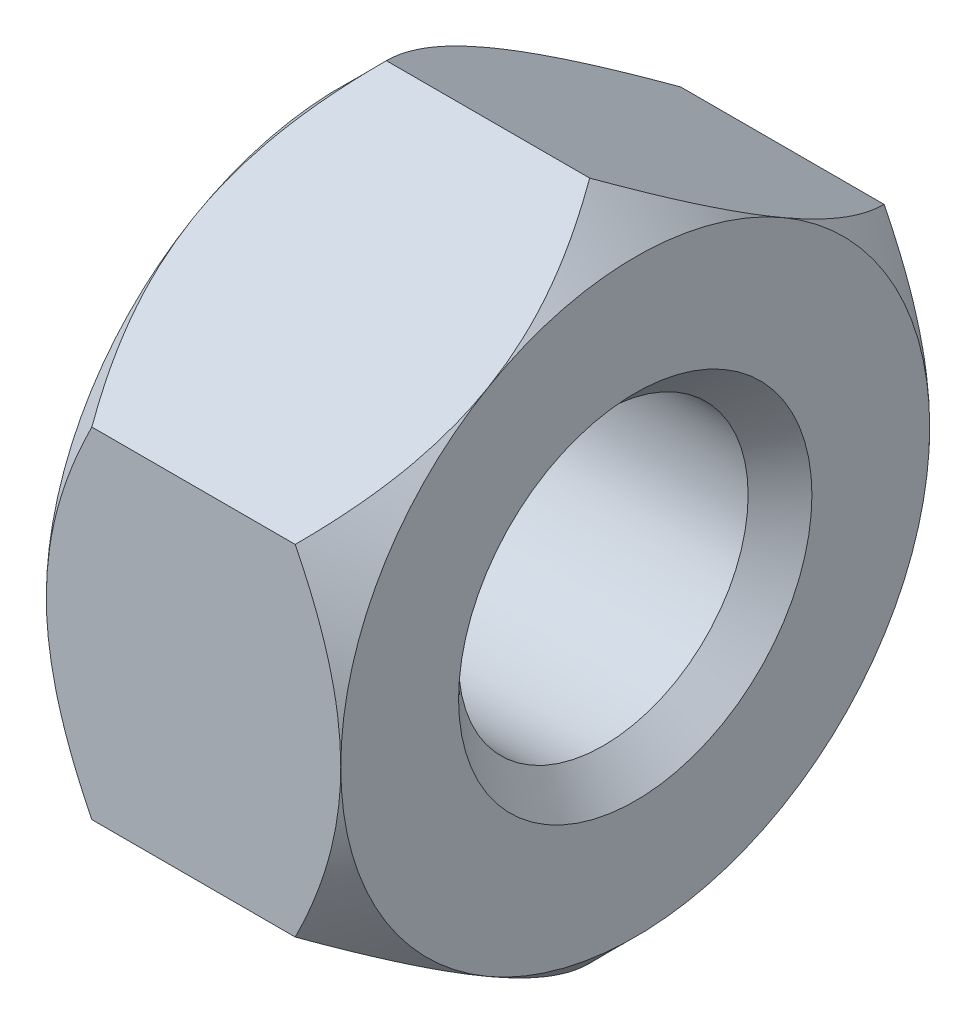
ISO-10303-21;
HEADER;
FILE_DESCRIPTION(('STEP AP214'),'2;1');
FILE_NAME('part.step','',(''),(''),'','','');
FILE_SCHEMA(('AUTOMOTIVE_DESIGN { 1 0 10303 214 1 1 1 1 }'));
ENDSEC;
DATA;
#1=APPLICATION_CONTEXT('core data for automotive mechanical design processes');
#2=APPLICATION_PROTOCOL_DEFINITION('international standard','automotive_design',2000,#1);
#3=PRODUCT_CONTEXT('',#1,'mechanical');
#4=PRODUCT('Part','Part','',(#3));
#5=PRODUCT_RELATED_PRODUCT_CATEGORY('part','',(#4));
#6=PRODUCT_DEFINITION_FORMATION('','',#4);
#7=PRODUCT_DEFINITION_CONTEXT('part definition',#1,'design');
#8=PRODUCT_DEFINITION('design','',#6,#7);
#9=PRODUCT_DEFINITION_SHAPE('','',#8);
#10=(LENGTH_UNIT() NAMED_UNIT(*) SI_UNIT(.MILLI.,.METRE.));
#11=(NAMED_UNIT(*) PLANE_ANGLE_UNIT() SI_UNIT($,.RADIAN.));
#12=(NAMED_UNIT(*) SI_UNIT($,.STERADIAN.) SOLID_ANGLE_UNIT());
#13=UNCERTAINTY_MEASURE_WITH_UNIT(LENGTH_MEASURE(1.E-05),#10,'distance_accuracy_value','');
#14=(GEOMETRIC_REPRESENTATION_CONTEXT(3) GLOBAL_UNCERTAINTY_ASSIGNED_CONTEXT((#13)) GLOBAL_UNIT_ASSIGNED_CONTEXT((#10,
#11,#12)) REPRESENTATION_CONTEXT('',''));
#15=CARTESIAN_POINT('',(0.,0.,0.));
#16=DIRECTION('',(0.,0.,1.));
#17=DIRECTION('',(1.,0.,0.));
#18=AXIS2_PLACEMENT_3D('',#15,#16,#17);
#19=CARTESIAN_POINT('',(1.,0.,0.));
#20=DIRECTION('',(1.,0.,0.));
#21=DIRECTION('',(0.,0.,-1.));
#22=AXIS2_PLACEMENT_3D('',#19,#20,#21);
#23=CONICAL_SURFACE('',#22,6.,0.785398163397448);
#24=CARTESIAN_POINT('',(2.8998967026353,-6.11623805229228,-5.));
#25=CARTESIAN_POINT('',(2.78578832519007,-5.96881967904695,-5.));
#26=CARTESIAN_POINT('',(2.67267681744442,-5.82061751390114,-5.));
#27=CARTESIAN_POINT('',(2.44890598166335,-5.52232154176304,-5.));
#28=CARTESIAN_POINT('',(2.3382472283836,-5.37222730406,-5.));
#29=CARTESIAN_POINT('',(2.11905330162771,-5.06872758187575,-5.));
#30=CARTESIAN_POINT('',(2.01054103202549,-4.91530550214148,-5.));
#31=CARTESIAN_POINT('',(1.79720519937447,-4.60592635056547,-5.));
#32=CARTESIAN_POINT('',(1.69238138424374,-4.44996945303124,-5.));
#33=CARTESIAN_POINT('',(1.48054287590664,-4.12476064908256,-5.));
#34=CARTESIAN_POINT('',(1.37383538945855,-3.95530762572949,-5.));
#35=CARTESIAN_POINT('',(1.16691630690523,-3.6124168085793,-5.));
#36=CARTESIAN_POINT('',(1.06670582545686,-3.43897833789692,-5.));
#37=CARTESIAN_POINT('',(0.874905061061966,-3.08804784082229,-5.));
#38=CARTESIAN_POINT('',(0.783289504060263,-2.91056973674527,-5.));
#39=CARTESIAN_POINT('',(0.610731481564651,-2.55053951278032,-5.));
#40=CARTESIAN_POINT('',(0.529783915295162,-2.36798986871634,-5.));
#41=CARTESIAN_POINT('',(0.389256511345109,-2.0167294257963,-5.));
#42=CARTESIAN_POINT('',(0.328328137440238,-1.84856364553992,-5.));
#43=CARTESIAN_POINT('',(0.219924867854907,-1.50786920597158,-5.));
#44=CARTESIAN_POINT('',(0.172450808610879,-1.3353402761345,-5.));
#45=CARTESIAN_POINT('',(0.094350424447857,-0.990002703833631,-5.));
#46=CARTESIAN_POINT('',(0.0634120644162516,-0.817265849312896,-5.));
#47=CARTESIAN_POINT('',(0.0190421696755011,-0.46954548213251,-5.));
#48=CARTESIAN_POINT('',(0.00560676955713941,-0.294562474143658,-5.));
#49=CARTESIAN_POINT('',(-0.00256353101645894,0.0477036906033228,-5.));
#50=CARTESIAN_POINT('',(0.00186182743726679,0.214966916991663,-5.));
#51=CARTESIAN_POINT('',(0.0272192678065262,0.548228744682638,-5.));
#52=CARTESIAN_POINT('',(0.0481528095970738,0.714227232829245,-5.));
#53=CARTESIAN_POINT('',(0.105684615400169,1.04657494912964,-5.));
#54=CARTESIAN_POINT('',(0.142562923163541,1.21287485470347,-5.));
#55=CARTESIAN_POINT('',(0.229911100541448,1.54179706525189,-5.));
#56=CARTESIAN_POINT('',(0.280380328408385,1.70441954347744,-5.));
#57=CARTESIAN_POINT('',(0.395277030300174,2.03318818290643,-5.));
#58=CARTESIAN_POINT('',(0.460247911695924,2.19914218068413,-5.));
#59=CARTESIAN_POINT('',(0.600242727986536,2.52679192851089,-5.));
#60=CARTESIAN_POINT('',(0.675271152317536,2.68848573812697,-5.));
#61=CARTESIAN_POINT('',(0.833602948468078,3.00837157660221,-5.));
#62=CARTESIAN_POINT('',(0.916931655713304,3.16655096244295,-5.));
#63=CARTESIAN_POINT('',(1.09003257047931,3.47928908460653,-5.));
#64=CARTESIAN_POINT('',(1.17980379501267,3.63384836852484,-5.));
#65=CARTESIAN_POINT('',(1.35998001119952,3.93227446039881,-5.));
#66=CARTESIAN_POINT('',(1.45013548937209,4.07629271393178,-5.));
#67=CARTESIAN_POINT('',(1.63429529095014,4.36185452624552,-5.));
#68=CARTESIAN_POINT('',(1.72829990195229,4.50339789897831,-5.));
#69=CARTESIAN_POINT('',(1.91870984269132,4.78319864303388,-5.));
#70=CARTESIAN_POINT('',(2.01508994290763,4.92147324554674,-5.));
#71=CARTESIAN_POINT('',(2.21044237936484,5.19612379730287,-5.));
#72=CARTESIAN_POINT('',(2.30941399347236,5.33250025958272,-5.));
#73=CARTESIAN_POINT('',(2.40944669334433,5.46808012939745,-5.));
#74=B_SPLINE_CURVE_WITH_KNOTS('',3,(#24,#25,#26,#27,#28,#29,#30,#31,#32,#33,#34,#35,#36,#37,#38,
#39,#40,#41,#42,#43,#44,#45,#46,#47,#48,#49,#50,#51,#52,#53,#54,#55,#56,#57,#58,#59,#60,#61,#62,
#63,#64,#65,#66,#67,#68,#69,#70,#71,#72,#73),.UNSPECIFIED.,.F.,.F.,(4,2,2,2,2,2,2,2,2,2,2,2,2,2,
2,2,2,2,2,2,2,2,2,2,4),(0.,0.559273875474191,1.11867744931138,1.68238716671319,2.24605828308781,
2.84669811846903,3.44744073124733,4.046357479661,4.64498681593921,5.18111629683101,
5.71727910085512,6.24293106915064,6.76846693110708,7.26958890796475,7.77075520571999,
8.28110595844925,8.79143261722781,9.32568132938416,9.86016931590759,10.3963418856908,
10.9324328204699,11.442089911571,11.9517851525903,12.4574018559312,12.9628791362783),.UNSPECIFIED.);
#75=CARTESIAN_POINT('',(0.773502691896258,-2.88675134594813,-5.));
#76=VERTEX_POINT('',#75);
#77=CARTESIAN_POINT('',(0.,0.,-5.));
#78=VERTEX_POINT('',#77);
#79=EDGE_CURVE('E333',#76,#78,#74,.T.);
#80=ORIENTED_EDGE('',*,*,#79,.F.);
#81=CARTESIAN_POINT('',(0.773618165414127,-5.7736181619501,0.000200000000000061));
#82=CARTESIAN_POINT('',(0.723986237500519,-5.72398176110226,-0.0857727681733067));
#83=CARTESIAN_POINT('',(0.675877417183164,-5.67396382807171,-0.172406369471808));
#84=CARTESIAN_POINT('',(0.58316932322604,-5.57309004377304,-0.347124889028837));
#85=CARTESIAN_POINT('',(0.538571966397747,-5.5222337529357,-0.435210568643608));
#86=CARTESIAN_POINT('',(0.410361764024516,-5.367822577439,-0.702658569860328));
#87=CARTESIAN_POINT('',(0.332877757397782,-5.26296050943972,-0.884284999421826));
#88=CARTESIAN_POINT('',(0.200191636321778,-5.05149774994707,-1.25054924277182));
#89=CARTESIAN_POINT('',(0.144655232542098,-4.94495110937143,-1.4350934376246));
#90=CARTESIAN_POINT('',(0.0804131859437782,-4.78337944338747,-1.71494377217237));
#91=CARTESIAN_POINT('',(0.0621848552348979,-4.72928433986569,-1.80863923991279));
#92=CARTESIAN_POINT('',(0.0324948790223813,-4.6206360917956,-1.99682352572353));
#93=CARTESIAN_POINT('',(0.021032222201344,-4.56608301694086,-2.09131222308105));
#94=CARTESIAN_POINT('',(0.00181355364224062,-4.43314578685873,-2.32156625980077));
#95=CARTESIAN_POINT('',(-0.00221901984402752,-4.35461839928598,-2.45757968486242));
#96=CARTESIAN_POINT('',(0.00454854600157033,-4.19770514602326,-2.72936141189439));
#97=CARTESIAN_POINT('',(0.015353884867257,-4.1193193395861,-2.86512961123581));
#98=CARTESIAN_POINT('',(0.0511603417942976,-3.96328672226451,-3.13538603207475));
#99=CARTESIAN_POINT('',(0.0761773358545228,-3.88564083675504,-3.26987265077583));
#100=CARTESIAN_POINT('',(0.139047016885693,-3.73168360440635,-3.53653439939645));
#101=CARTESIAN_POINT('',(0.176898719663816,-3.65537215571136,-3.66870970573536));
#102=CARTESIAN_POINT('',(0.254772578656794,-3.51990355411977,-3.9033482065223));
#103=CARTESIAN_POINT('',(0.292746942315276,-3.4604464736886,-4.00633089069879));
#104=CARTESIAN_POINT('',(0.374815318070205,-3.34259967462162,-4.21044753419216));
#105=CARTESIAN_POINT('',(0.418909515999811,-3.28420998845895,-4.31158143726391));
#106=CARTESIAN_POINT('',(0.512229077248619,-3.16868188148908,-4.51168198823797));
#107=CARTESIAN_POINT('',(0.561438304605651,-3.11154017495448,-4.61065432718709));
#108=CARTESIAN_POINT('',(0.664341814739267,-2.99831490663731,-4.80676624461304));
#109=CARTESIAN_POINT('',(0.718033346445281,-2.94223072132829,-4.90390690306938));
#110=CARTESIAN_POINT('',(0.773618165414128,-2.88663587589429,-5.0002));
#111=B_SPLINE_CURVE_WITH_KNOTS('',3,(#81,#82,#83,#84,#85,#86,#87,#88,#89,#90,#91,#92,#93,#94,
#95,#96,#97,#98,#99,#100,#101,#102,#103,#104,#105,#106,#107,#108,#109,#110),.UNSPECIFIED.,.F.,
.F.,(4,2,2,2,2,2,2,2,2,2,2,2,2,2,4),(0.,0.332945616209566,0.666071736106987,1.33592065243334,
1.99513262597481,2.32409207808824,2.6530023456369,3.12358963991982,3.59434188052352,
4.06562104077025,4.53686407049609,4.91117956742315,5.28550643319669,5.65868635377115,
6.03163889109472),.UNSPECIFIED.);
#112=CARTESIAN_POINT('',(-6.0539832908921E-13,-4.33012701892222,-2.49999999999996));
#113=VERTEX_POINT('',#112);
#114=EDGE_CURVE('E168',#113,#76,#111,.T.);
#115=ORIENTED_EDGE('',*,*,#114,.F.);
#116=CARTESIAN_POINT('',(0.,0.,0.));
#117=DIRECTION('',(-1.,0.,0.));
#118=DIRECTION('',(0.,0.,1.));
#119=AXIS2_PLACEMENT_3D('',#116,#117,#118);
#120=CIRCLE('',#119,5.);
#121=EDGE_CURVE('E324',#78,#113,#120,.T.);
#122=ORIENTED_EDGE('',*,*,#121,.F.);
#123=EDGE_LOOP('',(#80,#115,#122));
#124=FACE_BOUND('',#123,.T.);
#125=ADVANCED_FACE('F16',(#124),#23,.T.);
#126=CARTESIAN_POINT('',(0.773502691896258,2.88675134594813,-5.));
#127=VERTEX_POINT('',#126);
#128=EDGE_CURVE('E176',#78,#127,#74,.T.);
#129=ORIENTED_EDGE('',*,*,#128,.F.);
#130=CARTESIAN_POINT('',(-6.05850612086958E-13,4.33012701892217,-2.50000000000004));
#131=VERTEX_POINT('',#130);
#132=EDGE_CURVE('E325',#131,#78,#120,.T.);
#133=ORIENTED_EDGE('',*,*,#132,.F.);
#134=CARTESIAN_POINT('',(0.773618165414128,2.88663587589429,-5.0002));
#135=CARTESIAN_POINT('',(0.723986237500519,2.93627227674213,-4.91422723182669));
#136=CARTESIAN_POINT('',(0.675877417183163,2.98629020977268,-4.82759363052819));
#137=CARTESIAN_POINT('',(0.583169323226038,3.08716399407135,-4.65287511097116));
#138=CARTESIAN_POINT('',(0.538571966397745,3.13802028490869,-4.56478943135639));
#139=CARTESIAN_POINT('',(0.410361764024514,3.29243146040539,-4.29734143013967));
#140=CARTESIAN_POINT('',(0.332877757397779,3.39729352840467,-4.11571500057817));
#141=CARTESIAN_POINT('',(0.200191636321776,3.60875628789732,-3.74945075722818));
#142=CARTESIAN_POINT('',(0.144655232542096,3.71530292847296,-3.56490656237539));
#143=CARTESIAN_POINT('',(0.0804131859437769,3.87687459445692,-3.28505622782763));
#144=CARTESIAN_POINT('',(0.0621848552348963,3.9309696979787,-3.19136076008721));
#145=CARTESIAN_POINT('',(0.03249487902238,4.03961794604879,-3.00317647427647));
#146=CARTESIAN_POINT('',(0.0210322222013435,4.09417102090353,-2.90868777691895));
#147=CARTESIAN_POINT('',(0.00181355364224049,4.22710825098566,-2.67843374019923));
#148=CARTESIAN_POINT('',(-0.00221901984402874,4.3056356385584,-2.54242031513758));
#149=CARTESIAN_POINT('',(0.00454854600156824,4.46254889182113,-2.27063858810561));
#150=CARTESIAN_POINT('',(0.0153538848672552,4.54093469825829,-2.13487038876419));
#151=CARTESIAN_POINT('',(0.051160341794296,4.69696731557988,-1.86461396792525));
#152=CARTESIAN_POINT('',(0.0761773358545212,4.77461320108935,-1.73012734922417));
#153=CARTESIAN_POINT('',(0.139047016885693,4.92857043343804,-1.46346560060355));
#154=CARTESIAN_POINT('',(0.176898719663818,5.00488188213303,-1.33129029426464));
#155=CARTESIAN_POINT('',(0.254772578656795,5.14035048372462,-1.0966517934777));
#156=CARTESIAN_POINT('',(0.292746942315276,5.19980756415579,-0.993669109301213));
#157=CARTESIAN_POINT('',(0.374815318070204,5.31765436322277,-0.789552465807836));
#158=CARTESIAN_POINT('',(0.418909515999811,5.37604404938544,-0.688418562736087));
#159=CARTESIAN_POINT('',(0.512229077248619,5.49157215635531,-0.488318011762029));
#160=CARTESIAN_POINT('',(0.56143830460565,5.54871386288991,-0.389345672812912));
#161=CARTESIAN_POINT('',(0.664341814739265,5.66193913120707,-0.193233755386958));
#162=CARTESIAN_POINT('',(0.718033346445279,5.7180233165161,-0.096093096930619));
#163=CARTESIAN_POINT('',(0.773618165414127,5.7736181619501,0.000199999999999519));
#164=B_SPLINE_CURVE_WITH_KNOTS('',3,(#134,#135,#136,#137,#138,#139,#140,#141,#142,#143,#144,
#145,#146,#147,#148,#149,#150,#151,#152,#153,#154,#155,#156,#157,#158,#159,#160,#161,#162,#163),
.UNSPECIFIED.,.F.,.F.,(4,2,2,2,2,2,2,2,2,2,2,2,2,2,4),(0.,0.332945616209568,0.666071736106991,
1.33592065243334,1.99513262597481,2.32409207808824,2.6530023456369,3.12358963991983,
3.59434188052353,4.06562104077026,4.53686407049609,4.91117956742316,5.28550643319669,
5.65868635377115,6.03163889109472),.UNSPECIFIED.);
#165=EDGE_CURVE('E191',#127,#131,#164,.T.);
#166=ORIENTED_EDGE('',*,*,#165,.F.);
#167=EDGE_LOOP('',(#129,#133,#166));
#168=FACE_BOUND('',#167,.T.);
#169=ADVANCED_FACE('F150',(#168),#23,.T.);
#170=CARTESIAN_POINT('',(0.773502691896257,5.77350269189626,0.));
#171=VERTEX_POINT('',#170);
#172=EDGE_CURVE('E184',#131,#171,#164,.T.);
#173=ORIENTED_EDGE('',*,*,#172,.F.);
#174=CARTESIAN_POINT('',(-6.0539832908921E-13,4.33012701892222,2.49999999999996));
#175=VERTEX_POINT('',#174);
#176=EDGE_CURVE('E24',#175,#131,#120,.T.);
#177=ORIENTED_EDGE('',*,*,#176,.F.);
#178=CARTESIAN_POINT('',(0.773618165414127,5.7736181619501,-0.000200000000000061));
#179=CARTESIAN_POINT('',(0.723986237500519,5.72398176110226,0.0857727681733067));
#180=CARTESIAN_POINT('',(0.675877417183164,5.67396382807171,0.172406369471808));
#181=CARTESIAN_POINT('',(0.58316932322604,5.57309004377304,0.347124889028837));
#182=CARTESIAN_POINT('',(0.538571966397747,5.5222337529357,0.435210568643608));
#183=CARTESIAN_POINT('',(0.410361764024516,5.367822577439,0.702658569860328));
#184=CARTESIAN_POINT('',(0.332877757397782,5.26296050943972,0.884284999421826));
#185=CARTESIAN_POINT('',(0.200191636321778,5.05149774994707,1.25054924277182));
#186=CARTESIAN_POINT('',(0.144655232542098,4.94495110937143,1.4350934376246));
#187=CARTESIAN_POINT('',(0.0804131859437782,4.78337944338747,1.71494377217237));
#188=CARTESIAN_POINT('',(0.0621848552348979,4.72928433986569,1.80863923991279));
#189=CARTESIAN_POINT('',(0.0324948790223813,4.6206360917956,1.99682352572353));
#190=CARTESIAN_POINT('',(0.021032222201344,4.56608301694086,2.09131222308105));
#191=CARTESIAN_POINT('',(0.00181355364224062,4.43314578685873,2.32156625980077));
#192=CARTESIAN_POINT('',(-0.00221901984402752,4.35461839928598,2.45757968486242));
#193=CARTESIAN_POINT('',(0.00454854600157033,4.19770514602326,2.72936141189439));
#194=CARTESIAN_POINT('',(0.015353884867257,4.1193193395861,2.86512961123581));
#195=CARTESIAN_POINT('',(0.0511603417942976,3.96328672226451,3.13538603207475));
#196=CARTESIAN_POINT('',(0.0761773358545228,3.88564083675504,3.26987265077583));
#197=CARTESIAN_POINT('',(0.139047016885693,3.73168360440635,3.53653439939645));
#198=CARTESIAN_POINT('',(0.176898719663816,3.65537215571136,3.66870970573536));
#199=CARTESIAN_POINT('',(0.254772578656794,3.51990355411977,3.9033482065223));
#200=CARTESIAN_POINT('',(0.292746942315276,3.4604464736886,4.00633089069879));
#201=CARTESIAN_POINT('',(0.374815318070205,3.34259967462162,4.21044753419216));
#202=CARTESIAN_POINT('',(0.418909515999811,3.28420998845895,4.31158143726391));
#203=CARTESIAN_POINT('',(0.512229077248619,3.16868188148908,4.51168198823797));
#204=CARTESIAN_POINT('',(0.561438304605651,3.11154017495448,4.61065432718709));
#205=CARTESIAN_POINT('',(0.664341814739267,2.99831490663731,4.80676624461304));
#206=CARTESIAN_POINT('',(0.718033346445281,2.94223072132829,4.90390690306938));
#207=CARTESIAN_POINT('',(0.773618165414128,2.88663587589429,5.0002));
#208=B_SPLINE_CURVE_WITH_KNOTS('',3,(#178,#179,#180,#181,#182,#183,#184,#185,#186,#187,#188,
#189,#190,#191,#192,#193,#194,#195,#196,#197,#198,#199,#200,#201,#202,#203,#204,#205,#206,#207),
.UNSPECIFIED.,.F.,.F.,(4,2,2,2,2,2,2,2,2,2,2,2,2,2,4),(0.,0.332945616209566,0.666071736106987,
1.33592065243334,1.99513262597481,2.32409207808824,2.6530023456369,3.12358963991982,
3.59434188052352,4.06562104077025,4.53686407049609,4.91117956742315,5.28550643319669,
5.65868635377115,6.03163889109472),.UNSPECIFIED.);
#209=EDGE_CURVE('E113',#171,#175,#208,.T.);
#210=ORIENTED_EDGE('',*,*,#209,.F.);
#211=EDGE_LOOP('',(#173,#177,#210));
#212=FACE_BOUND('',#211,.T.);
#213=ADVANCED_FACE('F338',(#212),#23,.T.);
#214=CARTESIAN_POINT('',(0.773502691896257,-5.77350269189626,0.));
#215=VERTEX_POINT('',#214);
#216=EDGE_CURVE('E221',#215,#113,#111,.T.);
#217=ORIENTED_EDGE('',*,*,#216,.F.);
#218=CARTESIAN_POINT('',(0.773618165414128,-2.88663587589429,5.0002));
#219=CARTESIAN_POINT('',(0.723986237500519,-2.93627227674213,4.91422723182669));
#220=CARTESIAN_POINT('',(0.675877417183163,-2.98629020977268,4.82759363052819));
#221=CARTESIAN_POINT('',(0.583169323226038,-3.08716399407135,4.65287511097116));
#222=CARTESIAN_POINT('',(0.538571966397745,-3.13802028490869,4.56478943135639));
#223=CARTESIAN_POINT('',(0.410361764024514,-3.29243146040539,4.29734143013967));
#224=CARTESIAN_POINT('',(0.332877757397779,-3.39729352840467,4.11571500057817));
#225=CARTESIAN_POINT('',(0.200191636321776,-3.60875628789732,3.74945075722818));
#226=CARTESIAN_POINT('',(0.144655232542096,-3.71530292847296,3.56490656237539));
#227=CARTESIAN_POINT('',(0.0804131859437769,-3.87687459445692,3.28505622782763));
#228=CARTESIAN_POINT('',(0.0621848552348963,-3.9309696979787,3.19136076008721));
#229=CARTESIAN_POINT('',(0.03249487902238,-4.03961794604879,3.00317647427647));
#230=CARTESIAN_POINT('',(0.0210322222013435,-4.09417102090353,2.90868777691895));
#231=CARTESIAN_POINT('',(0.00181355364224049,-4.22710825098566,2.67843374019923));
#232=CARTESIAN_POINT('',(-0.00221901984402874,-4.3056356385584,2.54242031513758));
#233=CARTESIAN_POINT('',(0.00454854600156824,-4.46254889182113,2.27063858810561));
#234=CARTESIAN_POINT('',(0.0153538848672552,-4.54093469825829,2.13487038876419));
#235=CARTESIAN_POINT('',(0.051160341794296,-4.69696731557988,1.86461396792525));
#236=CARTESIAN_POINT('',(0.0761773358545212,-4.77461320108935,1.73012734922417));
#237=CARTESIAN_POINT('',(0.139047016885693,-4.92857043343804,1.46346560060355));
#238=CARTESIAN_POINT('',(0.176898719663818,-5.00488188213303,1.33129029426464));
#239=CARTESIAN_POINT('',(0.254772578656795,-5.14035048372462,1.0966517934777));
#240=CARTESIAN_POINT('',(0.292746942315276,-5.19980756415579,0.993669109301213));
#241=CARTESIAN_POINT('',(0.374815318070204,-5.31765436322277,0.789552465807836));
#242=CARTESIAN_POINT('',(0.418909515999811,-5.37604404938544,0.688418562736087));
#243=CARTESIAN_POINT('',(0.512229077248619,-5.49157215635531,0.488318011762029));
#244=CARTESIAN_POINT('',(0.56143830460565,-5.54871386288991,0.389345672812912));
#245=CARTESIAN_POINT('',(0.664341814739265,-5.66193913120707,0.193233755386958));
#246=CARTESIAN_POINT('',(0.718033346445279,-5.7180233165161,0.096093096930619));
#247=CARTESIAN_POINT('',(0.773618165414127,-5.7736181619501,-0.000199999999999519));
#248=B_SPLINE_CURVE_WITH_KNOTS('',3,(#218,#219,#220,#221,#222,#223,#224,#225,#226,#227,#228,
#229,#230,#231,#232,#233,#234,#235,#236,#237,#238,#239,#240,#241,#242,#243,#244,#245,#246,#247),
.UNSPECIFIED.,.F.,.F.,(4,2,2,2,2,2,2,2,2,2,2,2,2,2,4),(0.,0.332945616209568,0.666071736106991,
1.33592065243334,1.99513262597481,2.32409207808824,2.6530023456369,3.12358963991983,
3.59434188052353,4.06562104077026,4.53686407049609,4.91117956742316,5.28550643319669,
5.65868635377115,6.03163889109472),.UNSPECIFIED.);
#249=CARTESIAN_POINT('',(-6.05850612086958E-13,-4.33012701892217,2.50000000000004));
#250=VERTEX_POINT('',#249);
#251=EDGE_CURVE('E160',#250,#215,#248,.T.);
#252=ORIENTED_EDGE('',*,*,#251,.F.);
#253=EDGE_CURVE('E322',#113,#250,#120,.T.);
#254=ORIENTED_EDGE('',*,*,#253,.F.);
#255=EDGE_LOOP('',(#217,#252,#254));
#256=FACE_BOUND('',#255,.T.);
#257=ADVANCED_FACE('F336',(#256),#23,.T.);
#258=CARTESIAN_POINT('',(0.773502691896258,2.88675134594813,5.));
#259=VERTEX_POINT('',#258);
#260=EDGE_CURVE('E107',#175,#259,#208,.T.);
#261=ORIENTED_EDGE('',*,*,#260,.F.);
#262=CARTESIAN_POINT('',(0.,0.,5.));
#263=VERTEX_POINT('',#262);
#264=EDGE_CURVE('E11',#263,#175,#120,.T.);
#265=ORIENTED_EDGE('',*,*,#264,.F.);
#266=CARTESIAN_POINT('',(2.8998967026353,-6.11623805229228,5.));
#267=CARTESIAN_POINT('',(2.78578832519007,-5.96881967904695,5.));
#268=CARTESIAN_POINT('',(2.67267681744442,-5.82061751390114,5.));
#269=CARTESIAN_POINT('',(2.44890598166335,-5.52232154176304,5.));
#270=CARTESIAN_POINT('',(2.3382472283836,-5.37222730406,5.));
#271=CARTESIAN_POINT('',(2.11905330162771,-5.06872758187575,5.));
#272=CARTESIAN_POINT('',(2.01054103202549,-4.91530550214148,5.));
#273=CARTESIAN_POINT('',(1.79720519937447,-4.60592635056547,5.));
#274=CARTESIAN_POINT('',(1.69238138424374,-4.44996945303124,5.));
#275=CARTESIAN_POINT('',(1.48054287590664,-4.12476064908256,5.));
#276=CARTESIAN_POINT('',(1.37383538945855,-3.95530762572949,5.));
#277=CARTESIAN_POINT('',(1.16691630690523,-3.6124168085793,5.));
#278=CARTESIAN_POINT('',(1.06670582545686,-3.43897833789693,5.));
#279=CARTESIAN_POINT('',(0.874905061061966,-3.08804784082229,5.));
#280=CARTESIAN_POINT('',(0.783289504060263,-2.91056973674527,5.));
#281=CARTESIAN_POINT('',(0.610731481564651,-2.55053951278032,5.));
#282=CARTESIAN_POINT('',(0.529783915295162,-2.36798986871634,5.));
#283=CARTESIAN_POINT('',(0.389256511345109,-2.0167294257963,5.));
#284=CARTESIAN_POINT('',(0.328328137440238,-1.84856364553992,5.));
#285=CARTESIAN_POINT('',(0.219924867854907,-1.50786920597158,5.));
#286=CARTESIAN_POINT('',(0.172450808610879,-1.3353402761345,5.));
#287=CARTESIAN_POINT('',(0.0943504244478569,-0.990002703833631,5.));
#288=CARTESIAN_POINT('',(0.0634120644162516,-0.817265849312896,5.));
#289=CARTESIAN_POINT('',(0.0190421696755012,-0.46954548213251,5.));
#290=CARTESIAN_POINT('',(0.00560676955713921,-0.294562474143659,5.));
#291=CARTESIAN_POINT('',(-0.00256353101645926,0.0477036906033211,5.));
#292=CARTESIAN_POINT('',(0.00186182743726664,0.214966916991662,5.));
#293=CARTESIAN_POINT('',(0.0272192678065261,0.548228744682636,5.));
#294=CARTESIAN_POINT('',(0.0481528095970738,0.714227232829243,5.));
#295=CARTESIAN_POINT('',(0.105684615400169,1.04657494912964,5.));
#296=CARTESIAN_POINT('',(0.14256292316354,1.21287485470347,5.));
#297=CARTESIAN_POINT('',(0.229911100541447,1.54179706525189,5.));
#298=CARTESIAN_POINT('',(0.280380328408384,1.70441954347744,5.));
#299=CARTESIAN_POINT('',(0.395277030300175,2.03318818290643,5.));
#300=CARTESIAN_POINT('',(0.460247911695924,2.19914218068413,5.));
#301=CARTESIAN_POINT('',(0.600242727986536,2.52679192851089,5.));
#302=CARTESIAN_POINT('',(0.675271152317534,2.68848573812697,5.));
#303=CARTESIAN_POINT('',(0.833602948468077,3.0083715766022,5.));
#304=CARTESIAN_POINT('',(0.916931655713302,3.16655096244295,5.));
#305=CARTESIAN_POINT('',(1.09003257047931,3.47928908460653,5.));
#306=CARTESIAN_POINT('',(1.17980379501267,3.63384836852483,5.));
#307=CARTESIAN_POINT('',(1.35998001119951,3.9322744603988,5.));
#308=CARTESIAN_POINT('',(1.45013548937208,4.07629271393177,5.));
#309=CARTESIAN_POINT('',(1.63429529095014,4.36185452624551,5.));
#310=CARTESIAN_POINT('',(1.72829990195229,4.5033978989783,5.));
#311=CARTESIAN_POINT('',(1.91870984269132,4.78319864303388,5.));
#312=CARTESIAN_POINT('',(2.01508994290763,4.92147324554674,5.));
#313=CARTESIAN_POINT('',(2.21044237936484,5.19612379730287,5.));
#314=CARTESIAN_POINT('',(2.30941399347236,5.33250025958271,5.));
#315=CARTESIAN_POINT('',(2.40944669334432,5.46808012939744,5.));
#316=B_SPLINE_CURVE_WITH_KNOTS('',3,(#266,#267,#268,#269,#270,#271,#272,#273,#274,#275,#276,
#277,#278,#279,#280,#281,#282,#283,#284,#285,#286,#287,#288,#289,#290,#291,#292,#293,#294,#295,
#296,#297,#298,#299,#300,#301,#302,#303,#304,#305,#306,#307,#308,#309,#310,#311,#312,#313,#314,
#315),.UNSPECIFIED.,.F.,.F.,(4,2,2,2,2,2,2,2,2,2,2,2,2,2,2,2,2,2,2,2,2,2,2,2,4),(0.,
0.559273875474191,1.11867744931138,1.68238716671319,2.24605828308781,2.84669811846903,
3.44744073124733,4.046357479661,4.64498681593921,5.18111629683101,5.71727910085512,
6.24293106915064,6.76846693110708,7.26958890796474,7.77075520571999,8.28110595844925,
8.79143261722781,9.32568132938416,9.86016931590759,10.3963418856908,10.9324328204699,
11.4420899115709,11.9517851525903,12.4574018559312,12.9628791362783),.UNSPECIFIED.);
#317=EDGE_CURVE('E32',#259,#263,#316,.F.);
#318=ORIENTED_EDGE('',*,*,#317,.F.);
#319=EDGE_LOOP('',(#261,#265,#318));
#320=FACE_BOUND('',#319,.T.);
#321=ADVANCED_FACE('F123',(#320),#23,.T.);
#322=CARTESIAN_POINT('',(0.773502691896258,-2.88675134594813,5.));
#323=VERTEX_POINT('',#322);
#324=EDGE_CURVE('E233',#323,#250,#248,.T.);
#325=ORIENTED_EDGE('',*,*,#324,.F.);
#326=EDGE_CURVE('E125',#263,#323,#316,.F.);
#327=ORIENTED_EDGE('',*,*,#326,.F.);
#328=EDGE_CURVE('E25',#250,#263,#120,.T.);
#329=ORIENTED_EDGE('',*,*,#328,.F.);
#330=EDGE_LOOP('',(#325,#327,#329));
#331=FACE_BOUND('',#330,.T.);
#332=ADVANCED_FACE('F152',(#331),#23,.T.);
#333=CARTESIAN_POINT('',(5.,0.,0.));
#334=DIRECTION('',(-1.,0.,0.));
#335=DIRECTION('',(0.,0.,1.));
#336=AXIS2_PLACEMENT_3D('',#333,#334,#335);
#337=CONICAL_SURFACE('',#336,5.,0.785398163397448);
#338=CARTESIAN_POINT('',(4.22638183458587,2.88663587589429,5.0002));
#339=CARTESIAN_POINT('',(4.27601376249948,2.93627227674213,4.91422723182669));
#340=CARTESIAN_POINT('',(4.32412258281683,2.98629020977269,4.82759363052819));
#341=CARTESIAN_POINT('',(4.41683067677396,3.08716399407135,4.65287511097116));
#342=CARTESIAN_POINT('',(4.46142803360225,3.13802028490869,4.56478943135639));
#343=CARTESIAN_POINT('',(4.58963823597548,3.29243146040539,4.29734143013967));
#344=CARTESIAN_POINT('',(4.66712224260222,3.39729352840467,4.11571500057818));
#345=CARTESIAN_POINT('',(4.79980836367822,3.60875628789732,3.74945075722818));
#346=CARTESIAN_POINT('',(4.8553447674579,3.71530292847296,3.5649065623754));
#347=CARTESIAN_POINT('',(4.91958681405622,3.87687459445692,3.28505622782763));
#348=CARTESIAN_POINT('',(4.9378151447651,3.9309696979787,3.19136076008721));
#349=CARTESIAN_POINT('',(4.96750512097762,4.03961794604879,3.00317647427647));
#350=CARTESIAN_POINT('',(4.97896777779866,4.09417102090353,2.90868777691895));
#351=CARTESIAN_POINT('',(4.99818644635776,4.22710825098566,2.67843374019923));
#352=CARTESIAN_POINT('',(5.00221901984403,4.3056356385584,2.54242031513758));
#353=CARTESIAN_POINT('',(4.99545145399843,4.46254889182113,2.27063858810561));
#354=CARTESIAN_POINT('',(4.98464611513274,4.54093469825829,2.13487038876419));
#355=CARTESIAN_POINT('',(4.9488396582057,4.69696731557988,1.86461396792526));
#356=CARTESIAN_POINT('',(4.92382266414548,4.77461320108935,1.73012734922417));
#357=CARTESIAN_POINT('',(4.86095298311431,4.92857043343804,1.46346560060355));
#358=CARTESIAN_POINT('',(4.82310128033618,5.00488188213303,1.33129029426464));
#359=CARTESIAN_POINT('',(4.74522742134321,5.14035048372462,1.0966517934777));
#360=CARTESIAN_POINT('',(4.70725305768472,5.19980756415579,0.993669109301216));
#361=CARTESIAN_POINT('',(4.6251846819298,5.31765436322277,0.789552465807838));
#362=CARTESIAN_POINT('',(4.58109048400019,5.37604404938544,0.688418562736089));
#363=CARTESIAN_POINT('',(4.48777092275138,5.49157215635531,0.48831801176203));
#364=CARTESIAN_POINT('',(4.43856169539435,5.54871386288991,0.389345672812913));
#365=CARTESIAN_POINT('',(4.33565818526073,5.66193913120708,0.193233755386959));
#366=CARTESIAN_POINT('',(4.28196665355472,5.7180233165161,0.0960930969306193));
#367=CARTESIAN_POINT('',(4.22638183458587,5.7736181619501,-0.000199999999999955));
#368=B_SPLINE_CURVE_WITH_KNOTS('',3,(#338,#339,#340,#341,#342,#343,#344,#345,#346,#347,#348,
#349,#350,#351,#352,#353,#354,#355,#356,#357,#358,#359,#360,#361,#362,#363,#364,#365,#366,#367),
.UNSPECIFIED.,.F.,.F.,(4,2,2,2,2,2,2,2,2,2,2,2,2,2,4),(0.,0.332945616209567,0.666071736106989,
1.33592065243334,1.99513262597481,2.32409207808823,2.6530023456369,3.12358963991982,
3.59434188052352,4.06562104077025,4.53686407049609,4.91117956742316,5.28550643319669,
5.65868635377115,6.03163889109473),.UNSPECIFIED.);
#369=CARTESIAN_POINT('',(4.22649730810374,2.88675134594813,5.));
#370=VERTEX_POINT('',#369);
#371=CARTESIAN_POINT('',(5.,4.3301270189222,2.5));
#372=VERTEX_POINT('',#371);
#373=EDGE_CURVE('E117',#370,#372,#368,.T.);
#374=ORIENTED_EDGE('',*,*,#373,.F.);
#375=CARTESIAN_POINT('',(2.1001032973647,-6.11623805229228,5.));
#376=CARTESIAN_POINT('',(2.21421167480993,-5.96881967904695,5.));
#377=CARTESIAN_POINT('',(2.32732318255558,-5.82061751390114,5.));
#378=CARTESIAN_POINT('',(2.55109401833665,-5.52232154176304,5.));
#379=CARTESIAN_POINT('',(2.6617527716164,-5.37222730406,5.));
#380=CARTESIAN_POINT('',(2.88094669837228,-5.06872758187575,5.));
#381=CARTESIAN_POINT('',(2.98945896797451,-4.91530550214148,5.));
#382=CARTESIAN_POINT('',(3.20279480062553,-4.60592635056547,5.));
#383=CARTESIAN_POINT('',(3.30761861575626,-4.44996945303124,5.));
#384=CARTESIAN_POINT('',(3.51945712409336,-4.12476064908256,5.));
#385=CARTESIAN_POINT('',(3.62616461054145,-3.9553076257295,5.));
#386=CARTESIAN_POINT('',(3.83308369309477,-3.6124168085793,5.));
#387=CARTESIAN_POINT('',(3.93329417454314,-3.43897833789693,5.));
#388=CARTESIAN_POINT('',(4.12509493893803,-3.08804784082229,5.));
#389=CARTESIAN_POINT('',(4.21671049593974,-2.91056973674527,5.));
#390=CARTESIAN_POINT('',(4.38926851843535,-2.55053951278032,5.));
#391=CARTESIAN_POINT('',(4.47021608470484,-2.36798986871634,5.));
#392=CARTESIAN_POINT('',(4.61074348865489,-2.0167294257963,5.));
#393=CARTESIAN_POINT('',(4.67167186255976,-1.84856364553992,5.));
#394=CARTESIAN_POINT('',(4.78007513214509,-1.50786920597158,5.));
#395=CARTESIAN_POINT('',(4.82754919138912,-1.3353402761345,5.));
#396=CARTESIAN_POINT('',(4.90564957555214,-0.990002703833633,5.));
#397=CARTESIAN_POINT('',(4.93658793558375,-0.817265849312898,5.));
#398=CARTESIAN_POINT('',(4.9809578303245,-0.469545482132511,5.));
#399=CARTESIAN_POINT('',(4.99439323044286,-0.294562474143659,5.));
#400=CARTESIAN_POINT('',(5.00256353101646,0.0477036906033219,5.));
#401=CARTESIAN_POINT('',(4.99813817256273,0.214966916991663,5.));
#402=CARTESIAN_POINT('',(4.97278073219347,0.548228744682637,5.));
#403=CARTESIAN_POINT('',(4.95184719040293,0.714227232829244,5.));
#404=CARTESIAN_POINT('',(4.89431538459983,1.04657494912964,5.));
#405=CARTESIAN_POINT('',(4.85743707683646,1.21287485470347,5.));
#406=CARTESIAN_POINT('',(4.77008889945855,1.54179706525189,5.));
#407=CARTESIAN_POINT('',(4.71961967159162,1.70441954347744,5.));
#408=CARTESIAN_POINT('',(4.60472296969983,2.03318818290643,5.));
#409=CARTESIAN_POINT('',(4.53975208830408,2.19914218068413,5.));
#410=CARTESIAN_POINT('',(4.39975727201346,2.52679192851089,5.));
#411=CARTESIAN_POINT('',(4.32472884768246,2.68848573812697,5.));
#412=CARTESIAN_POINT('',(4.16639705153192,3.00837157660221,5.));
#413=CARTESIAN_POINT('',(4.0830683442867,3.16655096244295,5.));
#414=CARTESIAN_POINT('',(3.90996742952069,3.47928908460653,5.));
#415=CARTESIAN_POINT('',(3.82019620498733,3.63384836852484,5.));
#416=CARTESIAN_POINT('',(3.64001998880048,3.93227446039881,5.));
#417=CARTESIAN_POINT('',(3.54986451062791,4.07629271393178,5.));
#418=CARTESIAN_POINT('',(3.36570470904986,4.36185452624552,5.));
#419=CARTESIAN_POINT('',(3.27170009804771,4.50339789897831,5.));
#420=CARTESIAN_POINT('',(3.08129015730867,4.78319864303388,5.));
#421=CARTESIAN_POINT('',(2.98491005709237,4.92147324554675,5.));
#422=CARTESIAN_POINT('',(2.78955762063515,5.19612379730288,5.));
#423=CARTESIAN_POINT('',(2.69058600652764,5.33250025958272,5.));
#424=CARTESIAN_POINT('',(2.59055330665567,5.46808012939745,5.));
#425=B_SPLINE_CURVE_WITH_KNOTS('',3,(#375,#376,#377,#378,#379,#380,#381,#382,#383,#384,#385,
#386,#387,#388,#389,#390,#391,#392,#393,#394,#395,#396,#397,#398,#399,#400,#401,#402,#403,#404,
#405,#406,#407,#408,#409,#410,#411,#412,#413,#414,#415,#416,#417,#418,#419,#420,#421,#422,#423,
#424),.UNSPECIFIED.,.F.,.F.,(4,2,2,2,2,2,2,2,2,2,2,2,2,2,2,2,2,2,2,2,2,2,2,2,4),(0.,
0.55927387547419,1.11867744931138,1.68238716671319,2.24605828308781,2.84669811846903,
3.44744073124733,4.046357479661,4.64498681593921,5.18111629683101,5.71727910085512,
6.24293106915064,6.76846693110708,7.26958890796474,7.77075520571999,8.28110595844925,
8.79143261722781,9.32568132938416,9.86016931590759,10.3963418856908,10.9324328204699,
11.442089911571,11.9517851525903,12.4574018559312,12.9628791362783),.UNSPECIFIED.);
#426=CARTESIAN_POINT('',(5.,0.,5.));
#427=VERTEX_POINT('',#426);
#428=EDGE_CURVE('E120',#427,#370,#425,.T.);
#429=ORIENTED_EDGE('',*,*,#428,.F.);
#430=CARTESIAN_POINT('',(5.,0.,0.));
#431=DIRECTION('',(-1.,0.,0.));
#432=DIRECTION('',(0.,0.,1.));
#433=AXIS2_PLACEMENT_3D('',#430,#431,#432);
#434=CIRCLE('',#433,5.);
#435=EDGE_CURVE('E263',#427,#372,#434,.T.);
#436=ORIENTED_EDGE('',*,*,#435,.T.);
#437=EDGE_LOOP('',(#374,#429,#436));
#438=FACE_BOUND('',#437,.T.);
#439=ADVANCED_FACE('F153',(#438),#337,.T.);
#440=CARTESIAN_POINT('',(4.22649730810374,5.77350269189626,0.));
#441=VERTEX_POINT('',#440);
#442=EDGE_CURVE('E198',#372,#441,#368,.T.);
#443=ORIENTED_EDGE('',*,*,#442,.F.);
#444=CARTESIAN_POINT('',(5.,4.3301270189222,-2.5));
#445=VERTEX_POINT('',#444);
#446=EDGE_CURVE('E269',#372,#445,#434,.T.);
#447=ORIENTED_EDGE('',*,*,#446,.T.);
#448=CARTESIAN_POINT('',(4.22638183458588,5.77361816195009,0.0002));
#449=CARTESIAN_POINT('',(4.27601376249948,5.72398176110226,-0.0857727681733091));
#450=CARTESIAN_POINT('',(4.32412258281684,5.6739638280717,-0.172406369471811));
#451=CARTESIAN_POINT('',(4.41683067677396,5.57309004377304,-0.347124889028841));
#452=CARTESIAN_POINT('',(4.46142803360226,5.5222337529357,-0.435210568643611));
#453=CARTESIAN_POINT('',(4.58963823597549,5.367822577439,-0.702658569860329));
#454=CARTESIAN_POINT('',(4.66712224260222,5.26296050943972,-0.884284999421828));
#455=CARTESIAN_POINT('',(4.79980836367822,5.05149774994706,-1.25054924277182));
#456=CARTESIAN_POINT('',(4.8553447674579,4.94495110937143,-1.4350934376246));
#457=CARTESIAN_POINT('',(4.91958681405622,4.78337944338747,-1.71494377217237));
#458=CARTESIAN_POINT('',(4.9378151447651,4.72928433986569,-1.80863923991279));
#459=CARTESIAN_POINT('',(4.96750512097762,4.6206360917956,-1.99682352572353));
#460=CARTESIAN_POINT('',(4.97896777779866,4.56608301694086,-2.09131222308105));
#461=CARTESIAN_POINT('',(4.99818644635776,4.43314578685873,-2.32156625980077));
#462=CARTESIAN_POINT('',(5.00221901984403,4.35461839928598,-2.45757968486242));
#463=CARTESIAN_POINT('',(4.99545145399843,4.19770514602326,-2.72936141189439));
#464=CARTESIAN_POINT('',(4.98464611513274,4.1193193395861,-2.86512961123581));
#465=CARTESIAN_POINT('',(4.9488396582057,3.96328672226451,-3.13538603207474));
#466=CARTESIAN_POINT('',(4.92382266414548,3.88564083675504,-3.26987265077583));
#467=CARTESIAN_POINT('',(4.86095298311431,3.73168360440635,-3.53653439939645));
#468=CARTESIAN_POINT('',(4.82310128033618,3.65537215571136,-3.66870970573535));
#469=CARTESIAN_POINT('',(4.74522742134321,3.51990355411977,-3.9033482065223));
#470=CARTESIAN_POINT('',(4.70725305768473,3.4604464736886,-4.00633089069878));
#471=CARTESIAN_POINT('',(4.6251846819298,3.34259967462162,-4.21044753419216));
#472=CARTESIAN_POINT('',(4.58109048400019,3.28420998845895,-4.31158143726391));
#473=CARTESIAN_POINT('',(4.48777092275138,3.16868188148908,-4.51168198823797));
#474=CARTESIAN_POINT('',(4.43856169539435,3.11154017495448,-4.61065432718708));
#475=CARTESIAN_POINT('',(4.33565818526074,2.99831490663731,-4.80676624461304));
#476=CARTESIAN_POINT('',(4.28196665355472,2.94223072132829,-4.90390690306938));
#477=CARTESIAN_POINT('',(4.22638183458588,2.88663587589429,-5.0002));
#478=B_SPLINE_CURVE_WITH_KNOTS('',3,(#448,#449,#450,#451,#452,#453,#454,#455,#456,#457,#458,
#459,#460,#461,#462,#463,#464,#465,#466,#467,#468,#469,#470,#471,#472,#473,#474,#475,#476,#477),
.UNSPECIFIED.,.F.,.F.,(4,2,2,2,2,2,2,2,2,2,2,2,2,2,4),(0.,0.332945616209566,0.666071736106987,
1.33592065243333,1.99513262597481,2.32409207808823,2.6530023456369,3.12358963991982,
3.59434188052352,4.06562104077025,4.53686407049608,4.91117956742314,5.28550643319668,
5.65868635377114,6.03163889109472),.UNSPECIFIED.);
#479=EDGE_CURVE('E192',#441,#445,#478,.T.);
#480=ORIENTED_EDGE('',*,*,#479,.F.);
#481=EDGE_LOOP('',(#443,#447,#480));
#482=FACE_BOUND('',#481,.T.);
#483=ADVANCED_FACE('F366',(#482),#337,.T.);
#484=CARTESIAN_POINT('',(4.22649730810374,2.88675134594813,-5.));
#485=VERTEX_POINT('',#484);
#486=EDGE_CURVE('E193',#445,#485,#478,.T.);
#487=ORIENTED_EDGE('',*,*,#486,.F.);
#488=CARTESIAN_POINT('',(5.,0.,-5.));
#489=VERTEX_POINT('',#488);
#490=EDGE_CURVE('E267',#445,#489,#434,.T.);
#491=ORIENTED_EDGE('',*,*,#490,.T.);
#492=CARTESIAN_POINT('',(2.1001032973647,-6.11623805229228,-5.));
#493=CARTESIAN_POINT('',(2.21421167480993,-5.96881967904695,-5.));
#494=CARTESIAN_POINT('',(2.32732318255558,-5.82061751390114,-5.));
#495=CARTESIAN_POINT('',(2.55109401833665,-5.52232154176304,-5.));
#496=CARTESIAN_POINT('',(2.6617527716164,-5.37222730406,-5.));
#497=CARTESIAN_POINT('',(2.88094669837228,-5.06872758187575,-5.));
#498=CARTESIAN_POINT('',(2.98945896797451,-4.91530550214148,-5.));
#499=CARTESIAN_POINT('',(3.20279480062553,-4.60592635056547,-5.));
#500=CARTESIAN_POINT('',(3.30761861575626,-4.44996945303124,-5.));
#501=CARTESIAN_POINT('',(3.51945712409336,-4.12476064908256,-5.));
#502=CARTESIAN_POINT('',(3.62616461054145,-3.9553076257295,-5.));
#503=CARTESIAN_POINT('',(3.83308369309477,-3.6124168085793,-5.));
#504=CARTESIAN_POINT('',(3.93329417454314,-3.43897833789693,-5.));
#505=CARTESIAN_POINT('',(4.12509493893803,-3.08804784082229,-5.));
#506=CARTESIAN_POINT('',(4.21671049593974,-2.91056973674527,-5.));
#507=CARTESIAN_POINT('',(4.38926851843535,-2.55053951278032,-5.));
#508=CARTESIAN_POINT('',(4.47021608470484,-2.36798986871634,-5.));
#509=CARTESIAN_POINT('',(4.61074348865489,-2.0167294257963,-5.));
#510=CARTESIAN_POINT('',(4.67167186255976,-1.84856364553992,-5.));
#511=CARTESIAN_POINT('',(4.78007513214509,-1.50786920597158,-5.));
#512=CARTESIAN_POINT('',(4.82754919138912,-1.3353402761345,-5.));
#513=CARTESIAN_POINT('',(4.90564957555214,-0.990002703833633,-5.));
#514=CARTESIAN_POINT('',(4.93658793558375,-0.817265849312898,-5.));
#515=CARTESIAN_POINT('',(4.9809578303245,-0.469545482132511,-5.));
#516=CARTESIAN_POINT('',(4.99439323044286,-0.294562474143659,-5.));
#517=CARTESIAN_POINT('',(5.00256353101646,0.0477036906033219,-5.));
#518=CARTESIAN_POINT('',(4.99813817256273,0.214966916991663,-5.));
#519=CARTESIAN_POINT('',(4.97278073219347,0.548228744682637,-5.));
#520=CARTESIAN_POINT('',(4.95184719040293,0.714227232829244,-5.));
#521=CARTESIAN_POINT('',(4.89431538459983,1.04657494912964,-5.));
#522=CARTESIAN_POINT('',(4.85743707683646,1.21287485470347,-5.));
#523=CARTESIAN_POINT('',(4.77008889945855,1.54179706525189,-5.));
#524=CARTESIAN_POINT('',(4.71961967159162,1.70441954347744,-5.));
#525=CARTESIAN_POINT('',(4.60472296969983,2.03318818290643,-5.));
#526=CARTESIAN_POINT('',(4.53975208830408,2.19914218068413,-5.));
#527=CARTESIAN_POINT('',(4.39975727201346,2.52679192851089,-5.));
#528=CARTESIAN_POINT('',(4.32472884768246,2.68848573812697,-5.));
#529=CARTESIAN_POINT('',(4.16639705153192,3.00837157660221,-5.));
#530=CARTESIAN_POINT('',(4.0830683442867,3.16655096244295,-5.));
#531=CARTESIAN_POINT('',(3.90996742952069,3.47928908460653,-5.));
#532=CARTESIAN_POINT('',(3.82019620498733,3.63384836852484,-5.));
#533=CARTESIAN_POINT('',(3.64001998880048,3.93227446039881,-5.));
#534=CARTESIAN_POINT('',(3.54986451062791,4.07629271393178,-5.));
#535=CARTESIAN_POINT('',(3.36570470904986,4.36185452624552,-5.));
#536=CARTESIAN_POINT('',(3.27170009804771,4.50339789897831,-5.));
#537=CARTESIAN_POINT('',(3.08129015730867,4.78319864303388,-5.));
#538=CARTESIAN_POINT('',(2.98491005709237,4.92147324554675,-5.));
#539=CARTESIAN_POINT('',(2.78955762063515,5.19612379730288,-5.));
#540=CARTESIAN_POINT('',(2.69058600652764,5.33250025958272,-5.));
#541=CARTESIAN_POINT('',(2.59055330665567,5.46808012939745,-5.));
#542=B_SPLINE_CURVE_WITH_KNOTS('',3,(#492,#493,#494,#495,#496,#497,#498,#499,#500,#501,#502,
#503,#504,#505,#506,#507,#508,#509,#510,#511,#512,#513,#514,#515,#516,#517,#518,#519,#520,#521,
#522,#523,#524,#525,#526,#527,#528,#529,#530,#531,#532,#533,#534,#535,#536,#537,#538,#539,#540,
#541),.UNSPECIFIED.,.F.,.F.,(4,2,2,2,2,2,2,2,2,2,2,2,2,2,2,2,2,2,2,2,2,2,2,2,4),(0.,
0.55927387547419,1.11867744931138,1.68238716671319,2.24605828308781,2.84669811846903,
3.44744073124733,4.046357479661,4.64498681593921,5.18111629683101,5.71727910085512,
6.24293106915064,6.76846693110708,7.26958890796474,7.77075520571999,8.28110595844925,
8.79143261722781,9.32568132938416,9.86016931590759,10.3963418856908,10.9324328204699,
11.442089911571,11.9517851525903,12.4574018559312,12.9628791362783),.UNSPECIFIED.);
#543=EDGE_CURVE('E220',#485,#489,#542,.F.);
#544=ORIENTED_EDGE('',*,*,#543,.F.);
#545=EDGE_LOOP('',(#487,#491,#544));
#546=FACE_BOUND('',#545,.T.);
#547=ADVANCED_FACE('F372',(#546),#337,.T.);
#548=CARTESIAN_POINT('',(4.22649730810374,-2.88675134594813,-5.));
#549=VERTEX_POINT('',#548);
#550=EDGE_CURVE('E215',#489,#549,#542,.F.);
#551=ORIENTED_EDGE('',*,*,#550,.F.);
#552=CARTESIAN_POINT('',(5.,-4.3301270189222,-2.5));
#553=VERTEX_POINT('',#552);
#554=EDGE_CURVE('E266',#489,#553,#434,.T.);
#555=ORIENTED_EDGE('',*,*,#554,.T.);
#556=CARTESIAN_POINT('',(4.22638183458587,-2.88663587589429,-5.0002));
#557=CARTESIAN_POINT('',(4.27601376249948,-2.93627227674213,-4.91422723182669));
#558=CARTESIAN_POINT('',(4.32412258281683,-2.98629020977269,-4.82759363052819));
#559=CARTESIAN_POINT('',(4.41683067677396,-3.08716399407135,-4.65287511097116));
#560=CARTESIAN_POINT('',(4.46142803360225,-3.13802028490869,-4.56478943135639));
#561=CARTESIAN_POINT('',(4.58963823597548,-3.29243146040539,-4.29734143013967));
#562=CARTESIAN_POINT('',(4.66712224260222,-3.39729352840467,-4.11571500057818));
#563=CARTESIAN_POINT('',(4.79980836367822,-3.60875628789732,-3.74945075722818));
#564=CARTESIAN_POINT('',(4.8553447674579,-3.71530292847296,-3.5649065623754));
#565=CARTESIAN_POINT('',(4.91958681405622,-3.87687459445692,-3.28505622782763));
#566=CARTESIAN_POINT('',(4.9378151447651,-3.9309696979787,-3.19136076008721));
#567=CARTESIAN_POINT('',(4.96750512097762,-4.03961794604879,-3.00317647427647));
#568=CARTESIAN_POINT('',(4.97896777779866,-4.09417102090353,-2.90868777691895));
#569=CARTESIAN_POINT('',(4.99818644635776,-4.22710825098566,-2.67843374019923));
#570=CARTESIAN_POINT('',(5.00221901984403,-4.3056356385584,-2.54242031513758));
#571=CARTESIAN_POINT('',(4.99545145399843,-4.46254889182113,-2.27063858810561));
#572=CARTESIAN_POINT('',(4.98464611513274,-4.54093469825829,-2.13487038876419));
#573=CARTESIAN_POINT('',(4.9488396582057,-4.69696731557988,-1.86461396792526));
#574=CARTESIAN_POINT('',(4.92382266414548,-4.77461320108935,-1.73012734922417));
#575=CARTESIAN_POINT('',(4.86095298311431,-4.92857043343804,-1.46346560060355));
#576=CARTESIAN_POINT('',(4.82310128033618,-5.00488188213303,-1.33129029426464));
#577=CARTESIAN_POINT('',(4.74522742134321,-5.14035048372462,-1.0966517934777));
#578=CARTESIAN_POINT('',(4.70725305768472,-5.19980756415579,-0.993669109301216));
#579=CARTESIAN_POINT('',(4.6251846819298,-5.31765436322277,-0.789552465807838));
#580=CARTESIAN_POINT('',(4.58109048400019,-5.37604404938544,-0.688418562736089));
#581=CARTESIAN_POINT('',(4.48777092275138,-5.49157215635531,-0.48831801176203));
#582=CARTESIAN_POINT('',(4.43856169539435,-5.54871386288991,-0.389345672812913));
#583=CARTESIAN_POINT('',(4.33565818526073,-5.66193913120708,-0.193233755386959));
#584=CARTESIAN_POINT('',(4.28196665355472,-5.7180233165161,-0.0960930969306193));
#585=CARTESIAN_POINT('',(4.22638183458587,-5.7736181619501,0.000199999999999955));
#586=B_SPLINE_CURVE_WITH_KNOTS('',3,(#556,#557,#558,#559,#560,#561,#562,#563,#564,#565,#566,
#567,#568,#569,#570,#571,#572,#573,#574,#575,#576,#577,#578,#579,#580,#581,#582,#583,#584,#585),
.UNSPECIFIED.,.F.,.F.,(4,2,2,2,2,2,2,2,2,2,2,2,2,2,4),(0.,0.332945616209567,0.666071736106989,
1.33592065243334,1.99513262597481,2.32409207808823,2.6530023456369,3.12358963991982,
3.59434188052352,4.06562104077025,4.53686407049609,4.91117956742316,5.28550643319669,
5.65868635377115,6.03163889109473),.UNSPECIFIED.);
#587=EDGE_CURVE('E229',#549,#553,#586,.T.);
#588=ORIENTED_EDGE('',*,*,#587,.F.);
#589=EDGE_LOOP('',(#551,#555,#588));
#590=FACE_BOUND('',#589,.T.);
#591=ADVANCED_FACE('F381',(#590),#337,.T.);
#592=CARTESIAN_POINT('',(4.22649730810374,-5.77350269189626,0.));
#593=VERTEX_POINT('',#592);
#594=EDGE_CURVE('E230',#553,#593,#586,.T.);
#595=ORIENTED_EDGE('',*,*,#594,.F.);
#596=CARTESIAN_POINT('',(5.,-4.3301270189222,2.5));
#597=VERTEX_POINT('',#596);
#598=EDGE_CURVE('E259',#553,#597,#434,.T.);
#599=ORIENTED_EDGE('',*,*,#598,.T.);
#600=CARTESIAN_POINT('',(4.22638183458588,-5.77361816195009,-0.0002));
#601=CARTESIAN_POINT('',(4.27601376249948,-5.72398176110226,0.0857727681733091));
#602=CARTESIAN_POINT('',(4.32412258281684,-5.6739638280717,0.172406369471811));
#603=CARTESIAN_POINT('',(4.41683067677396,-5.57309004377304,0.347124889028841));
#604=CARTESIAN_POINT('',(4.46142803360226,-5.5222337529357,0.435210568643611));
#605=CARTESIAN_POINT('',(4.58963823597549,-5.367822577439,0.702658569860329));
#606=CARTESIAN_POINT('',(4.66712224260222,-5.26296050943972,0.884284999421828));
#607=CARTESIAN_POINT('',(4.79980836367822,-5.05149774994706,1.25054924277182));
#608=CARTESIAN_POINT('',(4.8553447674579,-4.94495110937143,1.4350934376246));
#609=CARTESIAN_POINT('',(4.91958681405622,-4.78337944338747,1.71494377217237));
#610=CARTESIAN_POINT('',(4.9378151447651,-4.72928433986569,1.80863923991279));
#611=CARTESIAN_POINT('',(4.96750512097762,-4.6206360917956,1.99682352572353));
#612=CARTESIAN_POINT('',(4.97896777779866,-4.56608301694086,2.09131222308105));
#613=CARTESIAN_POINT('',(4.99818644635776,-4.43314578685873,2.32156625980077));
#614=CARTESIAN_POINT('',(5.00221901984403,-4.35461839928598,2.45757968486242));
#615=CARTESIAN_POINT('',(4.99545145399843,-4.19770514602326,2.72936141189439));
#616=CARTESIAN_POINT('',(4.98464611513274,-4.1193193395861,2.86512961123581));
#617=CARTESIAN_POINT('',(4.9488396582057,-3.96328672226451,3.13538603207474));
#618=CARTESIAN_POINT('',(4.92382266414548,-3.88564083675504,3.26987265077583));
#619=CARTESIAN_POINT('',(4.86095298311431,-3.73168360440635,3.53653439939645));
#620=CARTESIAN_POINT('',(4.82310128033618,-3.65537215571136,3.66870970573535));
#621=CARTESIAN_POINT('',(4.74522742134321,-3.51990355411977,3.9033482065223));
#622=CARTESIAN_POINT('',(4.70725305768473,-3.4604464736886,4.00633089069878));
#623=CARTESIAN_POINT('',(4.6251846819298,-3.34259967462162,4.21044753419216));
#624=CARTESIAN_POINT('',(4.58109048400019,-3.28420998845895,4.31158143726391));
#625=CARTESIAN_POINT('',(4.48777092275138,-3.16868188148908,4.51168198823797));
#626=CARTESIAN_POINT('',(4.43856169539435,-3.11154017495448,4.61065432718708));
#627=CARTESIAN_POINT('',(4.33565818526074,-2.99831490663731,4.80676624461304));
#628=CARTESIAN_POINT('',(4.28196665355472,-2.94223072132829,4.90390690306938));
#629=CARTESIAN_POINT('',(4.22638183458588,-2.88663587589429,5.0002));
#630=B_SPLINE_CURVE_WITH_KNOTS('',3,(#600,#601,#602,#603,#604,#605,#606,#607,#608,#609,#610,
#611,#612,#613,#614,#615,#616,#617,#618,#619,#620,#621,#622,#623,#624,#625,#626,#627,#628,#629),
.UNSPECIFIED.,.F.,.F.,(4,2,2,2,2,2,2,2,2,2,2,2,2,2,4),(0.,0.332945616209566,0.666071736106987,
1.33592065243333,1.99513262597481,2.32409207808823,2.6530023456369,3.12358963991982,
3.59434188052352,4.06562104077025,4.53686407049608,4.91117956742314,5.28550643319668,
5.65868635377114,6.03163889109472),.UNSPECIFIED.);
#631=EDGE_CURVE('E127',#593,#597,#630,.T.);
#632=ORIENTED_EDGE('',*,*,#631,.F.);
#633=EDGE_LOOP('',(#595,#599,#632));
#634=FACE_BOUND('',#633,.T.);
#635=ADVANCED_FACE('F265',(#634),#337,.T.);
#636=CARTESIAN_POINT('',(4.22649730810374,-2.88675134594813,5.));
#637=VERTEX_POINT('',#636);
#638=EDGE_CURVE('E124',#597,#637,#630,.T.);
#639=ORIENTED_EDGE('',*,*,#638,.F.);
#640=EDGE_CURVE('E253',#597,#427,#434,.T.);
#641=ORIENTED_EDGE('',*,*,#640,.T.);
#642=EDGE_CURVE('E39',#637,#427,#425,.T.);
#643=ORIENTED_EDGE('',*,*,#642,.F.);
#644=EDGE_LOOP('',(#639,#641,#643));
#645=FACE_BOUND('',#644,.T.);
#646=ADVANCED_FACE('F252',(#645),#337,.T.);
#647=CARTESIAN_POINT('',(0.,0.,0.));
#648=DIRECTION('',(1.,0.,0.));
#649=DIRECTION('',(0.,0.,-1.));
#650=AXIS2_PLACEMENT_3D('',#647,#648,#649);
#651=PLANE('',#650);
#652=CARTESIAN_POINT('',(0.,0.,0.));
#653=DIRECTION('',(-1.,0.,0.));
#654=DIRECTION('',(0.,0.,1.));
#655=AXIS2_PLACEMENT_3D('',#652,#653,#654);
#656=CIRCLE('',#655,3.);
#657=CARTESIAN_POINT('',(0.,0.,3.));
#658=VERTEX_POINT('',#657);
#659=EDGE_CURVE('E264',#658,#658,#656,.T.);
#660=ORIENTED_EDGE('',*,*,#659,.F.);
#661=EDGE_LOOP('',(#660));
#662=FACE_BOUND('',#661,.T.);
#663=ORIENTED_EDGE('',*,*,#264,.T.);
#664=ORIENTED_EDGE('',*,*,#176,.T.);
#665=ORIENTED_EDGE('',*,*,#132,.T.);
#666=ORIENTED_EDGE('',*,*,#121,.T.);
#667=ORIENTED_EDGE('',*,*,#253,.T.);
#668=ORIENTED_EDGE('',*,*,#328,.T.);
#669=EDGE_LOOP('',(#663,#664,#665,#666,#667,#668));
#670=FACE_BOUND('',#669,.T.);
#671=ADVANCED_FACE('F18',(#662,#670),#651,.F.);
#672=CARTESIAN_POINT('',(5.,5.,0.));
#673=DIRECTION('',(-1.,0.,0.));
#674=DIRECTION('',(0.,0.,1.));
#675=AXIS2_PLACEMENT_3D('',#672,#673,#674);
#676=PLANE('',#675);
#677=CARTESIAN_POINT('',(5.,0.,0.));
#678=DIRECTION('',(-1.,0.,0.));
#679=DIRECTION('',(0.,0.,1.));
#680=AXIS2_PLACEMENT_3D('',#677,#678,#679);
#681=CIRCLE('',#680,3.);
#682=CARTESIAN_POINT('',(5.,0.,3.));
#683=VERTEX_POINT('',#682);
#684=EDGE_CURVE('E278',#683,#683,#681,.T.);
#685=ORIENTED_EDGE('',*,*,#684,.T.);
#686=EDGE_LOOP('',(#685));
#687=FACE_BOUND('',#686,.T.);
#688=ORIENTED_EDGE('',*,*,#435,.F.);
#689=ORIENTED_EDGE('',*,*,#640,.F.);
#690=ORIENTED_EDGE('',*,*,#598,.F.);
#691=ORIENTED_EDGE('',*,*,#554,.F.);
#692=ORIENTED_EDGE('',*,*,#490,.F.);
#693=ORIENTED_EDGE('',*,*,#446,.F.);
#694=EDGE_LOOP('',(#688,#689,#690,#691,#692,#693));
#695=FACE_BOUND('',#694,.T.);
#696=ADVANCED_FACE('F257',(#687,#695),#676,.F.);
#697=CARTESIAN_POINT('',(0.5415,0.,0.));
#698=DIRECTION('',(-1.,0.,0.));
#699=DIRECTION('',(0.,0.,1.));
#700=AXIS2_PLACEMENT_3D('',#697,#698,#699);
#701=CONICAL_SURFACE('',#700,2.4585,0.785398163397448);
#702=ORIENTED_EDGE('',*,*,#659,.T.);
#703=EDGE_LOOP('',(#702));
#704=FACE_BOUND('',#703,.T.);
#705=CARTESIAN_POINT('',(0.5415,0.,0.));
#706=DIRECTION('',(-1.,0.,0.));
#707=DIRECTION('',(0.,0.,1.));
#708=AXIS2_PLACEMENT_3D('',#705,#706,#707);
#709=CIRCLE('',#708,2.4585);
#710=CARTESIAN_POINT('',(0.5415,0.,2.4585));
#711=VERTEX_POINT('',#710);
#712=EDGE_CURVE('E272',#711,#711,#709,.T.);
#713=ORIENTED_EDGE('',*,*,#712,.F.);
#714=EDGE_LOOP('',(#713));
#715=FACE_BOUND('',#714,.T.);
#716=ADVANCED_FACE('F295',(#704,#715),#701,.F.);
#717=CARTESIAN_POINT('',(5.,0.,0.));
#718=DIRECTION('',(-1.,0.,0.));
#719=DIRECTION('',(0.,0.,1.));
#720=AXIS2_PLACEMENT_3D('',#717,#718,#719);
#721=CYLINDRICAL_SURFACE('',#720,2.4585);
#722=ORIENTED_EDGE('',*,*,#712,.T.);
#723=EDGE_LOOP('',(#722));
#724=FACE_BOUND('',#723,.T.);
#725=CARTESIAN_POINT('',(4.4585,0.,0.));
#726=DIRECTION('',(-1.,0.,0.));
#727=DIRECTION('',(0.,0.,1.));
#728=AXIS2_PLACEMENT_3D('',#725,#726,#727);
#729=CIRCLE('',#728,2.4585);
#730=CARTESIAN_POINT('',(4.4585,0.,2.4585));
#731=VERTEX_POINT('',#730);
#732=EDGE_CURVE('E275',#731,#731,#729,.T.);
#733=ORIENTED_EDGE('',*,*,#732,.F.);
#734=EDGE_LOOP('',(#733));
#735=FACE_BOUND('',#734,.T.);
#736=ADVANCED_FACE('F291',(#724,#735),#721,.F.);
#737=CARTESIAN_POINT('',(5.,0.,0.));
#738=DIRECTION('',(1.,0.,0.));
#739=DIRECTION('',(0.,0.,-1.));
#740=AXIS2_PLACEMENT_3D('',#737,#738,#739);
#741=CONICAL_SURFACE('',#740,3.,0.785398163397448);
#742=ORIENTED_EDGE('',*,*,#732,.T.);
#743=EDGE_LOOP('',(#742));
#744=FACE_BOUND('',#743,.T.);
#745=ORIENTED_EDGE('',*,*,#684,.F.);
#746=EDGE_LOOP('',(#745));
#747=FACE_BOUND('',#746,.T.);
#748=ADVANCED_FACE('F287',(#744,#747),#741,.F.);
#749=CARTESIAN_POINT('',(-20.,5.77350269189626,0.));
#750=DIRECTION('',(0.,0.866025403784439,0.5));
#751=DIRECTION('',(0.,-0.5,0.866025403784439));
#752=AXIS2_PLACEMENT_3D('',#749,#750,#751);
#753=PLANE('',#752);
#754=ORIENTED_EDGE('',*,*,#209,.T.);
#755=ORIENTED_EDGE('',*,*,#260,.T.);
#756=DIRECTION('',(1.,0.,0.));
#757=VECTOR('',#756,1.);
#758=CARTESIAN_POINT('',(-20.,2.88675134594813,5.));
#759=LINE('',#758,#757);
#760=EDGE_CURVE('E109',#259,#370,#759,.T.);
#761=ORIENTED_EDGE('',*,*,#760,.T.);
#762=ORIENTED_EDGE('',*,*,#373,.T.);
#763=ORIENTED_EDGE('',*,*,#442,.T.);
#764=DIRECTION('',(1.,0.,0.));
#765=VECTOR('',#764,1.);
#766=CARTESIAN_POINT('',(-20.,5.77350269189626,0.));
#767=LINE('',#766,#765);
#768=EDGE_CURVE('E351',#171,#441,#767,.T.);
#769=ORIENTED_EDGE('',*,*,#768,.F.);
#770=EDGE_LOOP('',(#754,#755,#761,#762,#763,#769));
#771=FACE_BOUND('',#770,.T.);
#772=ADVANCED_FACE('F108',(#771),#753,.T.);
#773=CARTESIAN_POINT('',(-20.,2.88675134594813,-5.));
#774=DIRECTION('',(0.,0.866025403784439,-0.5));
#775=DIRECTION('',(0.,0.5,0.866025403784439));
#776=AXIS2_PLACEMENT_3D('',#773,#774,#775);
#777=PLANE('',#776);
#778=ORIENTED_EDGE('',*,*,#165,.T.);
#779=ORIENTED_EDGE('',*,*,#172,.T.);
#780=ORIENTED_EDGE('',*,*,#768,.T.);
#781=ORIENTED_EDGE('',*,*,#479,.T.);
#782=ORIENTED_EDGE('',*,*,#486,.T.);
#783=DIRECTION('',(1.,0.,0.));
#784=VECTOR('',#783,1.);
#785=CARTESIAN_POINT('',(-20.,2.88675134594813,-5.));
#786=LINE('',#785,#784);
#787=EDGE_CURVE('E354',#127,#485,#786,.T.);
#788=ORIENTED_EDGE('',*,*,#787,.F.);
#789=EDGE_LOOP('',(#778,#779,#780,#781,#782,#788));
#790=FACE_BOUND('',#789,.T.);
#791=ADVANCED_FACE('F203',(#790),#777,.T.);
#792=CARTESIAN_POINT('',(-20.,-2.88675134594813,-5.));
#793=DIRECTION('',(0.,0.,-1.));
#794=DIRECTION('',(-1.,0.,0.));
#795=AXIS2_PLACEMENT_3D('',#792,#793,#794);
#796=PLANE('',#795);
#797=ORIENTED_EDGE('',*,*,#79,.T.);
#798=ORIENTED_EDGE('',*,*,#128,.T.);
#799=ORIENTED_EDGE('',*,*,#787,.T.);
#800=ORIENTED_EDGE('',*,*,#543,.T.);
#801=ORIENTED_EDGE('',*,*,#550,.T.);
#802=DIRECTION('',(1.,0.,0.));
#803=VECTOR('',#802,1.);
#804=CARTESIAN_POINT('',(-20.,-2.88675134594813,-5.));
#805=LINE('',#804,#803);
#806=EDGE_CURVE('E356',#76,#549,#805,.T.);
#807=ORIENTED_EDGE('',*,*,#806,.F.);
#808=EDGE_LOOP('',(#797,#798,#799,#800,#801,#807));
#809=FACE_BOUND('',#808,.T.);
#810=ADVANCED_FACE('F206',(#809),#796,.T.);
#811=CARTESIAN_POINT('',(-20.,-5.77350269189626,0.));
#812=DIRECTION('',(0.,-0.866025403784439,-0.5));
#813=DIRECTION('',(0.,0.5,-0.866025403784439));
#814=AXIS2_PLACEMENT_3D('',#811,#812,#813);
#815=PLANE('',#814);
#816=ORIENTED_EDGE('',*,*,#216,.T.);
#817=ORIENTED_EDGE('',*,*,#114,.T.);
#818=ORIENTED_EDGE('',*,*,#806,.T.);
#819=ORIENTED_EDGE('',*,*,#587,.T.);
#820=ORIENTED_EDGE('',*,*,#594,.T.);
#821=DIRECTION('',(1.,0.,0.));
#822=VECTOR('',#821,1.);
#823=CARTESIAN_POINT('',(-20.,-5.77350269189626,0.));
#824=LINE('',#823,#822);
#825=EDGE_CURVE('E246',#215,#593,#824,.T.);
#826=ORIENTED_EDGE('',*,*,#825,.F.);
#827=EDGE_LOOP('',(#816,#817,#818,#819,#820,#826));
#828=FACE_BOUND('',#827,.T.);
#829=ADVANCED_FACE('F211',(#828),#815,.T.);
#830=CARTESIAN_POINT('',(-20.,-2.88675134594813,5.));
#831=DIRECTION('',(0.,-0.866025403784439,0.5));
#832=DIRECTION('',(0.,-0.5,-0.866025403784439));
#833=AXIS2_PLACEMENT_3D('',#830,#831,#832);
#834=PLANE('',#833);
#835=ORIENTED_EDGE('',*,*,#324,.T.);
#836=ORIENTED_EDGE('',*,*,#251,.T.);
#837=ORIENTED_EDGE('',*,*,#825,.T.);
#838=ORIENTED_EDGE('',*,*,#631,.T.);
#839=ORIENTED_EDGE('',*,*,#638,.T.);
#840=DIRECTION('',(1.,0.,0.));
#841=VECTOR('',#840,1.);
#842=CARTESIAN_POINT('',(-20.,-2.88675134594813,5.));
#843=LINE('',#842,#841);
#844=EDGE_CURVE('E121',#323,#637,#843,.T.);
#845=ORIENTED_EDGE('',*,*,#844,.F.);
#846=EDGE_LOOP('',(#835,#836,#837,#838,#839,#845));
#847=FACE_BOUND('',#846,.T.);
#848=ADVANCED_FACE('F245',(#847),#834,.T.);
#849=CARTESIAN_POINT('',(-20.,2.88675134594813,5.));
#850=DIRECTION('',(0.,0.,1.));
#851=DIRECTION('',(1.,0.,0.));
#852=AXIS2_PLACEMENT_3D('',#849,#850,#851);
#853=PLANE('',#852);
#854=ORIENTED_EDGE('',*,*,#317,.T.);
#855=ORIENTED_EDGE('',*,*,#326,.T.);
#856=ORIENTED_EDGE('',*,*,#844,.T.);
#857=ORIENTED_EDGE('',*,*,#642,.T.);
#858=ORIENTED_EDGE('',*,*,#428,.T.);
#859=ORIENTED_EDGE('',*,*,#760,.F.);
#860=EDGE_LOOP('',(#854,#855,#856,#857,#858,#859));
#861=FACE_BOUND('',#860,.T.);
#862=ADVANCED_FACE('F119',(#861),#853,.T.);
#863=CLOSED_SHELL('',(#125,#169,#213,#257,#321,#332,#439,#483,#547,#591,#635,#646,#671,#696,
#716,#736,#748,#772,#791,#810,#829,#848,#862));
#864=MANIFOLD_SOLID_BREP('B1',#863);
#865=ADVANCED_BREP_SHAPE_REPRESENTATION('',(#18,#864),#14);
#866=SHAPE_DEFINITION_REPRESENTATION(#9,#865);
ENDSEC;
END-ISO-10303-21;
